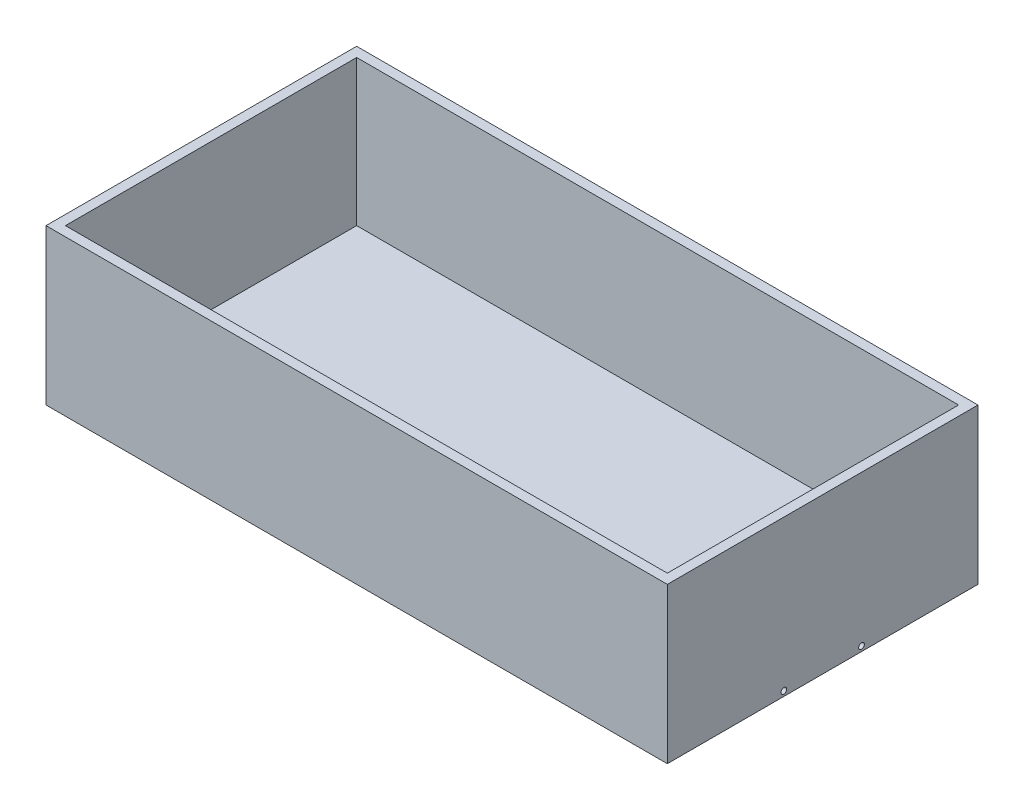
ISO-10303-21;
HEADER;
FILE_DESCRIPTION(('STEP AP214'),'2;1');
FILE_NAME('part.step','',(''),(''),'','','');
FILE_SCHEMA(('AUTOMOTIVE_DESIGN { 1 0 10303 214 1 1 1 1 }'));
ENDSEC;
DATA;
#1=APPLICATION_CONTEXT('core data for automotive mechanical design processes');
#2=APPLICATION_PROTOCOL_DEFINITION('international standard','automotive_design',2000,#1);
#3=PRODUCT_CONTEXT('',#1,'mechanical');
#4=PRODUCT('Part','Part','',(#3));
#5=PRODUCT_RELATED_PRODUCT_CATEGORY('part','',(#4));
#6=PRODUCT_DEFINITION_FORMATION('','',#4);
#7=PRODUCT_DEFINITION_CONTEXT('part definition',#1,'design');
#8=PRODUCT_DEFINITION('design','',#6,#7);
#9=PRODUCT_DEFINITION_SHAPE('','',#8);
#10=(LENGTH_UNIT() NAMED_UNIT(*) SI_UNIT(.MILLI.,.METRE.));
#11=(NAMED_UNIT(*) PLANE_ANGLE_UNIT() SI_UNIT($,.RADIAN.));
#12=(NAMED_UNIT(*) SI_UNIT($,.STERADIAN.) SOLID_ANGLE_UNIT());
#13=UNCERTAINTY_MEASURE_WITH_UNIT(LENGTH_MEASURE(1.E-05),#10,'distance_accuracy_value','');
#14=(GEOMETRIC_REPRESENTATION_CONTEXT(3) GLOBAL_UNCERTAINTY_ASSIGNED_CONTEXT((#13)) GLOBAL_UNIT_ASSIGNED_CONTEXT((#10,
#11,#12)) REPRESENTATION_CONTEXT('',''));
#15=CARTESIAN_POINT('',(0.,0.,0.));
#16=DIRECTION('',(0.,0.,1.));
#17=DIRECTION('',(1.,0.,0.));
#18=AXIS2_PLACEMENT_3D('',#15,#16,#17);
#19=CARTESIAN_POINT('',(-101.6,50.8,50.8));
#20=DIRECTION('',(1.,0.,0.));
#21=DIRECTION('',(0.,0.,-1.));
#22=AXIS2_PLACEMENT_3D('',#19,#20,#21);
#23=PLANE('',#22);
#24=DIRECTION('',(0.,0.,1.));
#25=VECTOR('',#24,1.);
#26=CARTESIAN_POINT('',(-101.6,0.,50.8));
#27=LINE('',#26,#25);
#28=CARTESIAN_POINT('',(-101.6,0.,-50.8));
#29=VERTEX_POINT('',#28);
#30=CARTESIAN_POINT('',(-101.6,0.,50.8));
#31=VERTEX_POINT('',#30);
#32=EDGE_CURVE('E212',#29,#31,#27,.T.);
#33=ORIENTED_EDGE('',*,*,#32,.T.);
#34=DIRECTION('',(0.,-1.,0.));
#35=VECTOR('',#34,1.);
#36=CARTESIAN_POINT('',(-101.6,50.8,50.8));
#37=LINE('',#36,#35);
#38=CARTESIAN_POINT('',(-101.6,50.8,50.8));
#39=VERTEX_POINT('',#38);
#40=EDGE_CURVE('E216',#39,#31,#37,.T.);
#41=ORIENTED_EDGE('',*,*,#40,.F.);
#42=DIRECTION('',(0.,0.,1.));
#43=VECTOR('',#42,1.);
#44=CARTESIAN_POINT('',(-101.6,50.8,50.8));
#45=LINE('',#44,#43);
#46=CARTESIAN_POINT('',(-101.6,50.8,-50.8));
#47=VERTEX_POINT('',#46);
#48=EDGE_CURVE('E204',#47,#39,#45,.T.);
#49=ORIENTED_EDGE('',*,*,#48,.F.);
#50=DIRECTION('',(0.,-1.,0.));
#51=VECTOR('',#50,1.);
#52=CARTESIAN_POINT('',(-101.6,50.8,-50.8));
#53=LINE('',#52,#51);
#54=EDGE_CURVE('E41',#47,#29,#53,.T.);
#55=ORIENTED_EDGE('',*,*,#54,.T.);
#56=EDGE_LOOP('',(#33,#41,#49,#55));
#57=FACE_BOUND('',#56,.T.);
#58=CARTESIAN_POINT('',(-101.6,1.5875,12.696070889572));
#59=DIRECTION('',(-1.,0.,0.));
#60=DIRECTION('',(0.,0.,1.));
#61=AXIS2_PLACEMENT_3D('',#58,#59,#60);
#62=CIRCLE('',#61,0.9271);
#63=CARTESIAN_POINT('',(-101.6,1.5875,13.623170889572));
#64=VERTEX_POINT('',#63);
#65=EDGE_CURVE('E158',#64,#64,#62,.T.);
#66=ORIENTED_EDGE('',*,*,#65,.F.);
#67=EDGE_LOOP('',(#66));
#68=FACE_BOUND('',#67,.T.);
#69=CARTESIAN_POINT('',(-101.6,1.5875,-12.703929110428));
#70=DIRECTION('',(-1.,0.,0.));
#71=DIRECTION('',(0.,0.,1.));
#72=AXIS2_PLACEMENT_3D('',#69,#70,#71);
#73=CIRCLE('',#72,0.927099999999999);
#74=CARTESIAN_POINT('',(-101.6,1.5875,-11.776829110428));
#75=VERTEX_POINT('',#74);
#76=EDGE_CURVE('E146',#75,#75,#73,.T.);
#77=ORIENTED_EDGE('',*,*,#76,.F.);
#78=EDGE_LOOP('',(#77));
#79=FACE_BOUND('',#78,.T.);
#80=ADVANCED_FACE('F33',(#57,#68,#79),#23,.F.);
#81=CARTESIAN_POINT('',(101.6,50.8,50.8));
#82=DIRECTION('',(-1.,0.,0.));
#83=DIRECTION('',(0.,0.,1.));
#84=AXIS2_PLACEMENT_3D('',#81,#82,#83);
#85=PLANE('',#84);
#86=CARTESIAN_POINT('',(101.6,1.5875,-12.703929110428));
#87=DIRECTION('',(1.,0.,0.));
#88=DIRECTION('',(0.,0.,-1.));
#89=AXIS2_PLACEMENT_3D('',#86,#87,#88);
#90=CIRCLE('',#89,0.927099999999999);
#91=CARTESIAN_POINT('',(101.6,1.5875,-13.631029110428));
#92=VERTEX_POINT('',#91);
#93=EDGE_CURVE('E256',#92,#92,#90,.T.);
#94=ORIENTED_EDGE('',*,*,#93,.F.);
#95=EDGE_LOOP('',(#94));
#96=FACE_BOUND('',#95,.T.);
#97=CARTESIAN_POINT('',(101.6,1.5875,12.696070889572));
#98=DIRECTION('',(1.,0.,0.));
#99=DIRECTION('',(0.,0.,-1.));
#100=AXIS2_PLACEMENT_3D('',#97,#98,#99);
#101=CIRCLE('',#100,0.9271);
#102=CARTESIAN_POINT('',(101.6,1.5875,11.768970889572));
#103=VERTEX_POINT('',#102);
#104=EDGE_CURVE('E127',#103,#103,#101,.T.);
#105=ORIENTED_EDGE('',*,*,#104,.F.);
#106=EDGE_LOOP('',(#105));
#107=FACE_BOUND('',#106,.T.);
#108=DIRECTION('',(0.,0.,-1.));
#109=VECTOR('',#108,1.);
#110=CARTESIAN_POINT('',(101.6,0.,50.8));
#111=LINE('',#110,#109);
#112=CARTESIAN_POINT('',(101.6,0.,50.8));
#113=VERTEX_POINT('',#112);
#114=CARTESIAN_POINT('',(101.6,0.,-50.8));
#115=VERTEX_POINT('',#114);
#116=EDGE_CURVE('E195',#113,#115,#111,.T.);
#117=ORIENTED_EDGE('',*,*,#116,.T.);
#118=DIRECTION('',(0.,-1.,0.));
#119=VECTOR('',#118,1.);
#120=CARTESIAN_POINT('',(101.6,50.8,-50.8));
#121=LINE('',#120,#119);
#122=CARTESIAN_POINT('',(101.6,50.8,-50.8));
#123=VERTEX_POINT('',#122);
#124=EDGE_CURVE('E11',#123,#115,#121,.T.);
#125=ORIENTED_EDGE('',*,*,#124,.F.);
#126=DIRECTION('',(0.,0.,-1.));
#127=VECTOR('',#126,1.);
#128=CARTESIAN_POINT('',(101.6,50.8,50.8));
#129=LINE('',#128,#127);
#130=CARTESIAN_POINT('',(101.6,50.8,50.8));
#131=VERTEX_POINT('',#130);
#132=EDGE_CURVE('E201',#131,#123,#129,.T.);
#133=ORIENTED_EDGE('',*,*,#132,.F.);
#134=DIRECTION('',(0.,-1.,0.));
#135=VECTOR('',#134,1.);
#136=CARTESIAN_POINT('',(101.6,50.8,50.8));
#137=LINE('',#136,#135);
#138=EDGE_CURVE('E207',#131,#113,#137,.T.);
#139=ORIENTED_EDGE('',*,*,#138,.T.);
#140=EDGE_LOOP('',(#117,#125,#133,#139));
#141=FACE_BOUND('',#140,.T.);
#142=ADVANCED_FACE('F35',(#96,#107,#141),#85,.F.);
#143=CARTESIAN_POINT('',(-101.6,50.8,-50.8));
#144=DIRECTION('',(0.,0.,1.));
#145=DIRECTION('',(1.,0.,0.));
#146=AXIS2_PLACEMENT_3D('',#143,#144,#145);
#147=PLANE('',#146);
#148=DIRECTION('',(-1.,0.,0.));
#149=VECTOR('',#148,1.);
#150=CARTESIAN_POINT('',(-101.6,0.,-50.8));
#151=LINE('',#150,#149);
#152=EDGE_CURVE('E210',#115,#29,#151,.T.);
#153=ORIENTED_EDGE('',*,*,#152,.T.);
#154=ORIENTED_EDGE('',*,*,#54,.F.);
#155=DIRECTION('',(-1.,0.,0.));
#156=VECTOR('',#155,1.);
#157=CARTESIAN_POINT('',(-101.6,50.8,-50.8));
#158=LINE('',#157,#156);
#159=EDGE_CURVE('E85',#123,#47,#158,.T.);
#160=ORIENTED_EDGE('',*,*,#159,.F.);
#161=ORIENTED_EDGE('',*,*,#124,.T.);
#162=EDGE_LOOP('',(#153,#154,#160,#161));
#163=FACE_BOUND('',#162,.T.);
#164=ADVANCED_FACE('F232',(#163),#147,.F.);
#165=CARTESIAN_POINT('',(-101.6,50.8,50.8));
#166=DIRECTION('',(0.,0.,-1.));
#167=DIRECTION('',(-1.,0.,0.));
#168=AXIS2_PLACEMENT_3D('',#165,#166,#167);
#169=PLANE('',#168);
#170=DIRECTION('',(1.,0.,0.));
#171=VECTOR('',#170,1.);
#172=CARTESIAN_POINT('',(-101.6,0.,50.8));
#173=LINE('',#172,#171);
#174=EDGE_CURVE('E78',#31,#113,#173,.T.);
#175=ORIENTED_EDGE('',*,*,#174,.T.);
#176=ORIENTED_EDGE('',*,*,#138,.F.);
#177=DIRECTION('',(1.,0.,0.));
#178=VECTOR('',#177,1.);
#179=CARTESIAN_POINT('',(-101.6,50.8,50.8));
#180=LINE('',#179,#178);
#181=EDGE_CURVE('E57',#39,#131,#180,.T.);
#182=ORIENTED_EDGE('',*,*,#181,.F.);
#183=ORIENTED_EDGE('',*,*,#40,.T.);
#184=EDGE_LOOP('',(#175,#176,#182,#183));
#185=FACE_BOUND('',#184,.T.);
#186=ADVANCED_FACE('F229',(#185),#169,.F.);
#187=CARTESIAN_POINT('',(0.,50.8,0.));
#188=DIRECTION('',(0.,-1.,0.));
#189=DIRECTION('',(0.,0.,-1.));
#190=AXIS2_PLACEMENT_3D('',#187,#188,#189);
#191=PLANE('',#190);
#192=DIRECTION('',(-1.,0.,0.));
#193=VECTOR('',#192,1.);
#194=CARTESIAN_POINT('',(-98.4249999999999,50.8,-47.625));
#195=LINE('',#194,#193);
#196=CARTESIAN_POINT('',(98.425,50.8,-47.625));
#197=VERTEX_POINT('',#196);
#198=CARTESIAN_POINT('',(-98.4249999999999,50.8,-47.625));
#199=VERTEX_POINT('',#198);
#200=EDGE_CURVE('E185',#197,#199,#195,.T.);
#201=ORIENTED_EDGE('',*,*,#200,.F.);
#202=DIRECTION('',(0.,0.,-1.));
#203=VECTOR('',#202,1.);
#204=CARTESIAN_POINT('',(98.425,50.8,47.625));
#205=LINE('',#204,#203);
#206=CARTESIAN_POINT('',(98.425,50.8,47.625));
#207=VERTEX_POINT('',#206);
#208=EDGE_CURVE('E48',#207,#197,#205,.T.);
#209=ORIENTED_EDGE('',*,*,#208,.F.);
#210=DIRECTION('',(1.,0.,0.));
#211=VECTOR('',#210,1.);
#212=CARTESIAN_POINT('',(-98.4249999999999,50.8,47.625));
#213=LINE('',#212,#211);
#214=CARTESIAN_POINT('',(-98.4249999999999,50.8,47.625));
#215=VERTEX_POINT('',#214);
#216=EDGE_CURVE('E174',#215,#207,#213,.T.);
#217=ORIENTED_EDGE('',*,*,#216,.F.);
#218=DIRECTION('',(0.,0.,1.));
#219=VECTOR('',#218,1.);
#220=CARTESIAN_POINT('',(-98.4249999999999,50.8,47.625));
#221=LINE('',#220,#219);
#222=EDGE_CURVE('E188',#199,#215,#221,.T.);
#223=ORIENTED_EDGE('',*,*,#222,.F.);
#224=EDGE_LOOP('',(#201,#209,#217,#223));
#225=FACE_BOUND('',#224,.T.);
#226=ORIENTED_EDGE('',*,*,#132,.T.);
#227=ORIENTED_EDGE('',*,*,#159,.T.);
#228=ORIENTED_EDGE('',*,*,#48,.T.);
#229=ORIENTED_EDGE('',*,*,#181,.T.);
#230=EDGE_LOOP('',(#226,#227,#228,#229));
#231=FACE_BOUND('',#230,.T.);
#232=ADVANCED_FACE('F231',(#225,#231),#191,.F.);
#233=CARTESIAN_POINT('',(0.,0.,0.));
#234=DIRECTION('',(0.,-1.,0.));
#235=DIRECTION('',(0.,0.,-1.));
#236=AXIS2_PLACEMENT_3D('',#233,#234,#235);
#237=PLANE('',#236);
#238=ORIENTED_EDGE('',*,*,#116,.F.);
#239=ORIENTED_EDGE('',*,*,#174,.F.);
#240=ORIENTED_EDGE('',*,*,#32,.F.);
#241=ORIENTED_EDGE('',*,*,#152,.F.);
#242=EDGE_LOOP('',(#238,#239,#240,#241));
#243=FACE_BOUND('',#242,.T.);
#244=ADVANCED_FACE('F225',(#243),#237,.T.);
#245=CARTESIAN_POINT('',(98.425,3.175,47.625));
#246=DIRECTION('',(1.,0.,0.));
#247=DIRECTION('',(0.,0.,-1.));
#248=AXIS2_PLACEMENT_3D('',#245,#246,#247);
#249=PLANE('',#248);
#250=ORIENTED_EDGE('',*,*,#208,.T.);
#251=DIRECTION('',(0.,1.,0.));
#252=VECTOR('',#251,1.);
#253=CARTESIAN_POINT('',(98.425,3.175,-47.625));
#254=LINE('',#253,#252);
#255=CARTESIAN_POINT('',(98.425,3.175,-47.625));
#256=VERTEX_POINT('',#255);
#257=EDGE_CURVE('E183',#256,#197,#254,.T.);
#258=ORIENTED_EDGE('',*,*,#257,.F.);
#259=DIRECTION('',(0.,0.,-1.));
#260=VECTOR('',#259,1.);
#261=CARTESIAN_POINT('',(98.425,3.175,47.625));
#262=LINE('',#261,#260);
#263=CARTESIAN_POINT('',(98.425,3.175,47.625));
#264=VERTEX_POINT('',#263);
#265=EDGE_CURVE('E170',#264,#256,#262,.T.);
#266=ORIENTED_EDGE('',*,*,#265,.F.);
#267=DIRECTION('',(0.,1.,0.));
#268=VECTOR('',#267,1.);
#269=CARTESIAN_POINT('',(98.425,3.175,47.625));
#270=LINE('',#269,#268);
#271=EDGE_CURVE('E193',#264,#207,#270,.T.);
#272=ORIENTED_EDGE('',*,*,#271,.T.);
#273=EDGE_LOOP('',(#250,#258,#266,#272));
#274=FACE_BOUND('',#273,.T.);
#275=ADVANCED_FACE('F320',(#274),#249,.F.);
#276=CARTESIAN_POINT('',(-98.4249999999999,3.175,47.625));
#277=DIRECTION('',(0.,0.,1.));
#278=DIRECTION('',(1.,0.,0.));
#279=AXIS2_PLACEMENT_3D('',#276,#277,#278);
#280=PLANE('',#279);
#281=ORIENTED_EDGE('',*,*,#216,.T.);
#282=ORIENTED_EDGE('',*,*,#271,.F.);
#283=DIRECTION('',(1.,0.,0.));
#284=VECTOR('',#283,1.);
#285=CARTESIAN_POINT('',(-98.4249999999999,3.175,47.625));
#286=LINE('',#285,#284);
#287=CARTESIAN_POINT('',(-98.4249999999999,3.175,47.625));
#288=VERTEX_POINT('',#287);
#289=EDGE_CURVE('E180',#288,#264,#286,.T.);
#290=ORIENTED_EDGE('',*,*,#289,.F.);
#291=DIRECTION('',(0.,1.,0.));
#292=VECTOR('',#291,1.);
#293=CARTESIAN_POINT('',(-98.4249999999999,3.175,47.625));
#294=LINE('',#293,#292);
#295=EDGE_CURVE('E196',#288,#215,#294,.T.);
#296=ORIENTED_EDGE('',*,*,#295,.T.);
#297=EDGE_LOOP('',(#281,#282,#290,#296));
#298=FACE_BOUND('',#297,.T.);
#299=ADVANCED_FACE('F316',(#298),#280,.F.);
#300=CARTESIAN_POINT('',(-98.4249999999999,3.175,47.625));
#301=DIRECTION('',(-1.,0.,0.));
#302=DIRECTION('',(0.,0.,1.));
#303=AXIS2_PLACEMENT_3D('',#300,#301,#302);
#304=PLANE('',#303);
#305=ORIENTED_EDGE('',*,*,#222,.T.);
#306=ORIENTED_EDGE('',*,*,#295,.F.);
#307=DIRECTION('',(0.,0.,1.));
#308=VECTOR('',#307,1.);
#309=CARTESIAN_POINT('',(-98.4249999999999,3.175,47.625));
#310=LINE('',#309,#308);
#311=CARTESIAN_POINT('',(-98.4249999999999,3.175,-47.625));
#312=VERTEX_POINT('',#311);
#313=EDGE_CURVE('E177',#312,#288,#310,.T.);
#314=ORIENTED_EDGE('',*,*,#313,.F.);
#315=DIRECTION('',(0.,1.,0.));
#316=VECTOR('',#315,1.);
#317=CARTESIAN_POINT('',(-98.4249999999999,3.175,-47.625));
#318=LINE('',#317,#316);
#319=EDGE_CURVE('E198',#312,#199,#318,.T.);
#320=ORIENTED_EDGE('',*,*,#319,.T.);
#321=EDGE_LOOP('',(#305,#306,#314,#320));
#322=FACE_BOUND('',#321,.T.);
#323=ADVANCED_FACE('F319',(#322),#304,.F.);
#324=CARTESIAN_POINT('',(-98.4249999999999,3.175,-47.625));
#325=DIRECTION('',(0.,0.,-1.));
#326=DIRECTION('',(-1.,0.,0.));
#327=AXIS2_PLACEMENT_3D('',#324,#325,#326);
#328=PLANE('',#327);
#329=ORIENTED_EDGE('',*,*,#200,.T.);
#330=ORIENTED_EDGE('',*,*,#319,.F.);
#331=DIRECTION('',(-1.,0.,0.));
#332=VECTOR('',#331,1.);
#333=CARTESIAN_POINT('',(-98.4249999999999,3.175,-47.625));
#334=LINE('',#333,#332);
#335=EDGE_CURVE('E173',#256,#312,#334,.T.);
#336=ORIENTED_EDGE('',*,*,#335,.F.);
#337=ORIENTED_EDGE('',*,*,#257,.T.);
#338=EDGE_LOOP('',(#329,#330,#336,#337));
#339=FACE_BOUND('',#338,.T.);
#340=ADVANCED_FACE('F314',(#339),#328,.F.);
#341=CARTESIAN_POINT('',(0.,3.175,0.));
#342=DIRECTION('',(0.,-1.,0.));
#343=DIRECTION('',(0.,0.,-1.));
#344=AXIS2_PLACEMENT_3D('',#341,#342,#343);
#345=PLANE('',#344);
#346=ORIENTED_EDGE('',*,*,#265,.T.);
#347=ORIENTED_EDGE('',*,*,#335,.T.);
#348=ORIENTED_EDGE('',*,*,#313,.T.);
#349=ORIENTED_EDGE('',*,*,#289,.T.);
#350=EDGE_LOOP('',(#346,#347,#348,#349));
#351=FACE_BOUND('',#350,.T.);
#352=ADVANCED_FACE('F310',(#351),#345,.F.);
#353=CARTESIAN_POINT('',(-96.52,1.5875,12.696070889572));
#354=DIRECTION('',(-1.,0.,0.));
#355=DIRECTION('',(0.,0.,1.));
#356=AXIS2_PLACEMENT_3D('',#353,#354,#355);
#357=CONICAL_SURFACE('',#356,0.755649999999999,1.02974425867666);
#358=CARTESIAN_POINT('',(-96.0659596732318,1.5875,12.696070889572));
#359=VERTEX_POINT('',#358);
#360=VERTEX_LOOP('',#359);
#361=FACE_BOUND('',#360,.T.);
#362=CARTESIAN_POINT('',(-96.52,1.5875,12.696070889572));
#363=DIRECTION('',(-1.,0.,0.));
#364=DIRECTION('',(0.,0.,1.));
#365=AXIS2_PLACEMENT_3D('',#362,#363,#364);
#366=CIRCLE('',#365,0.755649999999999);
#367=CARTESIAN_POINT('',(-96.52,1.5875,13.451720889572));
#368=VERTEX_POINT('',#367);
#369=EDGE_CURVE('E167',#368,#368,#366,.T.);
#370=ORIENTED_EDGE('',*,*,#369,.T.);
#371=EDGE_LOOP('',(#370));
#372=FACE_BOUND('',#371,.T.);
#373=ADVANCED_FACE('F306',(#361,#372),#357,.F.);
#374=CARTESIAN_POINT('',(-101.6,1.5875,12.696070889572));
#375=DIRECTION('',(-1.,0.,0.));
#376=DIRECTION('',(0.,0.,1.));
#377=AXIS2_PLACEMENT_3D('',#374,#375,#376);
#378=CYLINDRICAL_SURFACE('',#377,0.755649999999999);
#379=ORIENTED_EDGE('',*,*,#369,.F.);
#380=EDGE_LOOP('',(#379));
#381=FACE_BOUND('',#380,.T.);
#382=CARTESIAN_POINT('',(-97.79,1.5875,12.696070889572));
#383=DIRECTION('',(-1.,0.,0.));
#384=DIRECTION('',(0.,0.,1.));
#385=AXIS2_PLACEMENT_3D('',#382,#383,#384);
#386=CIRCLE('',#385,0.755649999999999);
#387=CARTESIAN_POINT('',(-97.79,1.5875,13.451720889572));
#388=VERTEX_POINT('',#387);
#389=EDGE_CURVE('E164',#388,#388,#386,.T.);
#390=ORIENTED_EDGE('',*,*,#389,.T.);
#391=EDGE_LOOP('',(#390));
#392=FACE_BOUND('',#391,.T.);
#393=ADVANCED_FACE('F302',(#381,#392),#378,.F.);
#394=CARTESIAN_POINT('',(-97.79,2.34315,12.696070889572));
#395=DIRECTION('',(1.,0.,0.));
#396=DIRECTION('',(0.,0.,-1.));
#397=AXIS2_PLACEMENT_3D('',#394,#395,#396);
#398=PLANE('',#397);
#399=ORIENTED_EDGE('',*,*,#389,.F.);
#400=EDGE_LOOP('',(#399));
#401=FACE_BOUND('',#400,.T.);
#402=CARTESIAN_POINT('',(-97.79,1.5875,12.696070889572));
#403=DIRECTION('',(-1.,0.,0.));
#404=DIRECTION('',(0.,0.,1.));
#405=AXIS2_PLACEMENT_3D('',#402,#403,#404);
#406=CIRCLE('',#405,0.927099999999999);
#407=CARTESIAN_POINT('',(-97.79,1.5875,13.623170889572));
#408=VERTEX_POINT('',#407);
#409=EDGE_CURVE('E161',#408,#408,#406,.T.);
#410=ORIENTED_EDGE('',*,*,#409,.T.);
#411=EDGE_LOOP('',(#410));
#412=FACE_BOUND('',#411,.T.);
#413=ADVANCED_FACE('F298',(#401,#412),#398,.F.);
#414=CARTESIAN_POINT('',(-101.6,1.5875,12.696070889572));
#415=DIRECTION('',(-1.,0.,0.));
#416=DIRECTION('',(0.,0.,1.));
#417=AXIS2_PLACEMENT_3D('',#414,#415,#416);
#418=CYLINDRICAL_SURFACE('',#417,0.927099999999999);
#419=ORIENTED_EDGE('',*,*,#409,.F.);
#420=EDGE_LOOP('',(#419));
#421=FACE_BOUND('',#420,.T.);
#422=ORIENTED_EDGE('',*,*,#65,.T.);
#423=EDGE_LOOP('',(#422));
#424=FACE_BOUND('',#423,.T.);
#425=ADVANCED_FACE('F294',(#421,#424),#418,.F.);
#426=CARTESIAN_POINT('',(-96.52,1.5875,-12.703929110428));
#427=DIRECTION('',(-1.,0.,0.));
#428=DIRECTION('',(0.,0.,1.));
#429=AXIS2_PLACEMENT_3D('',#426,#427,#428);
#430=CONICAL_SURFACE('',#429,0.755649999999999,1.02974425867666);
#431=CARTESIAN_POINT('',(-96.0659596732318,1.5875,-12.703929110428));
#432=VERTEX_POINT('',#431);
#433=VERTEX_LOOP('',#432);
#434=FACE_BOUND('',#433,.T.);
#435=CARTESIAN_POINT('',(-96.52,1.5875,-12.703929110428));
#436=DIRECTION('',(-1.,0.,0.));
#437=DIRECTION('',(0.,0.,1.));
#438=AXIS2_PLACEMENT_3D('',#435,#436,#437);
#439=CIRCLE('',#438,0.755649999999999);
#440=CARTESIAN_POINT('',(-96.52,1.5875,-11.948279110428));
#441=VERTEX_POINT('',#440);
#442=EDGE_CURVE('E155',#441,#441,#439,.T.);
#443=ORIENTED_EDGE('',*,*,#442,.T.);
#444=EDGE_LOOP('',(#443));
#445=FACE_BOUND('',#444,.T.);
#446=ADVANCED_FACE('F290',(#434,#445),#430,.F.);
#447=CARTESIAN_POINT('',(-101.6,1.5875,-12.703929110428));
#448=DIRECTION('',(-1.,0.,0.));
#449=DIRECTION('',(0.,0.,1.));
#450=AXIS2_PLACEMENT_3D('',#447,#448,#449);
#451=CYLINDRICAL_SURFACE('',#450,0.755649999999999);
#452=ORIENTED_EDGE('',*,*,#442,.F.);
#453=EDGE_LOOP('',(#452));
#454=FACE_BOUND('',#453,.T.);
#455=CARTESIAN_POINT('',(-97.79,1.5875,-12.703929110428));
#456=DIRECTION('',(-1.,0.,0.));
#457=DIRECTION('',(0.,0.,1.));
#458=AXIS2_PLACEMENT_3D('',#455,#456,#457);
#459=CIRCLE('',#458,0.755649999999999);
#460=CARTESIAN_POINT('',(-97.79,1.5875,-11.948279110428));
#461=VERTEX_POINT('',#460);
#462=EDGE_CURVE('E152',#461,#461,#459,.T.);
#463=ORIENTED_EDGE('',*,*,#462,.T.);
#464=EDGE_LOOP('',(#463));
#465=FACE_BOUND('',#464,.T.);
#466=ADVANCED_FACE('F286',(#454,#465),#451,.F.);
#467=CARTESIAN_POINT('',(-97.79,2.34315,-12.703929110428));
#468=DIRECTION('',(1.,0.,0.));
#469=DIRECTION('',(0.,0.,-1.));
#470=AXIS2_PLACEMENT_3D('',#467,#468,#469);
#471=PLANE('',#470);
#472=ORIENTED_EDGE('',*,*,#462,.F.);
#473=EDGE_LOOP('',(#472));
#474=FACE_BOUND('',#473,.T.);
#475=CARTESIAN_POINT('',(-97.79,1.5875,-12.703929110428));
#476=DIRECTION('',(-1.,0.,0.));
#477=DIRECTION('',(0.,0.,1.));
#478=AXIS2_PLACEMENT_3D('',#475,#476,#477);
#479=CIRCLE('',#478,0.927099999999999);
#480=CARTESIAN_POINT('',(-97.79,1.5875,-11.776829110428));
#481=VERTEX_POINT('',#480);
#482=EDGE_CURVE('E149',#481,#481,#479,.T.);
#483=ORIENTED_EDGE('',*,*,#482,.T.);
#484=EDGE_LOOP('',(#483));
#485=FACE_BOUND('',#484,.T.);
#486=ADVANCED_FACE('F282',(#474,#485),#471,.F.);
#487=CARTESIAN_POINT('',(-101.6,1.5875,-12.703929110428));
#488=DIRECTION('',(-1.,0.,0.));
#489=DIRECTION('',(0.,0.,1.));
#490=AXIS2_PLACEMENT_3D('',#487,#488,#489);
#491=CYLINDRICAL_SURFACE('',#490,0.927099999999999);
#492=ORIENTED_EDGE('',*,*,#482,.F.);
#493=EDGE_LOOP('',(#492));
#494=FACE_BOUND('',#493,.T.);
#495=ORIENTED_EDGE('',*,*,#76,.T.);
#496=EDGE_LOOP('',(#495));
#497=FACE_BOUND('',#496,.T.);
#498=ADVANCED_FACE('F278',(#494,#497),#491,.F.);
#499=CARTESIAN_POINT('',(96.52,1.5875,12.696070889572));
#500=DIRECTION('',(1.,0.,0.));
#501=DIRECTION('',(0.,0.,-1.));
#502=AXIS2_PLACEMENT_3D('',#499,#500,#501);
#503=CONICAL_SURFACE('',#502,0.755649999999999,1.02974425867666);
#504=CARTESIAN_POINT('',(96.0659596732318,1.5875,12.696070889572));
#505=VERTEX_POINT('',#504);
#506=VERTEX_LOOP('',#505);
#507=FACE_BOUND('',#506,.T.);
#508=CARTESIAN_POINT('',(96.52,1.5875,12.696070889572));
#509=DIRECTION('',(1.,0.,0.));
#510=DIRECTION('',(0.,0.,-1.));
#511=AXIS2_PLACEMENT_3D('',#508,#509,#510);
#512=CIRCLE('',#511,0.755649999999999);
#513=CARTESIAN_POINT('',(96.52,1.5875,11.940420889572));
#514=VERTEX_POINT('',#513);
#515=EDGE_CURVE('E143',#514,#514,#512,.T.);
#516=ORIENTED_EDGE('',*,*,#515,.T.);
#517=EDGE_LOOP('',(#516));
#518=FACE_BOUND('',#517,.T.);
#519=ADVANCED_FACE('F274',(#507,#518),#503,.F.);
#520=CARTESIAN_POINT('',(101.6,1.5875,12.696070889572));
#521=DIRECTION('',(1.,0.,0.));
#522=DIRECTION('',(0.,0.,-1.));
#523=AXIS2_PLACEMENT_3D('',#520,#521,#522);
#524=CYLINDRICAL_SURFACE('',#523,0.755649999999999);
#525=ORIENTED_EDGE('',*,*,#515,.F.);
#526=EDGE_LOOP('',(#525));
#527=FACE_BOUND('',#526,.T.);
#528=CARTESIAN_POINT('',(97.79,1.5875,12.696070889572));
#529=DIRECTION('',(1.,0.,0.));
#530=DIRECTION('',(0.,0.,-1.));
#531=AXIS2_PLACEMENT_3D('',#528,#529,#530);
#532=CIRCLE('',#531,0.755649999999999);
#533=CARTESIAN_POINT('',(97.79,1.5875,11.940420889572));
#534=VERTEX_POINT('',#533);
#535=EDGE_CURVE('E140',#534,#534,#532,.T.);
#536=ORIENTED_EDGE('',*,*,#535,.T.);
#537=EDGE_LOOP('',(#536));
#538=FACE_BOUND('',#537,.T.);
#539=ADVANCED_FACE('F266',(#527,#538),#524,.F.);
#540=CARTESIAN_POINT('',(97.79,2.34315,12.696070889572));
#541=DIRECTION('',(-1.,0.,0.));
#542=DIRECTION('',(0.,0.,1.));
#543=AXIS2_PLACEMENT_3D('',#540,#541,#542);
#544=PLANE('',#543);
#545=ORIENTED_EDGE('',*,*,#535,.F.);
#546=EDGE_LOOP('',(#545));
#547=FACE_BOUND('',#546,.T.);
#548=CARTESIAN_POINT('',(97.79,1.5875,12.696070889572));
#549=DIRECTION('',(1.,0.,0.));
#550=DIRECTION('',(0.,0.,-1.));
#551=AXIS2_PLACEMENT_3D('',#548,#549,#550);
#552=CIRCLE('',#551,0.927099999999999);
#553=CARTESIAN_POINT('',(97.79,1.5875,11.768970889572));
#554=VERTEX_POINT('',#553);
#555=EDGE_CURVE('E131',#554,#554,#552,.T.);
#556=ORIENTED_EDGE('',*,*,#555,.T.);
#557=EDGE_LOOP('',(#556));
#558=FACE_BOUND('',#557,.T.);
#559=ADVANCED_FACE('F260',(#547,#558),#544,.F.);
#560=CARTESIAN_POINT('',(101.6,1.5875,12.696070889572));
#561=DIRECTION('',(1.,0.,0.));
#562=DIRECTION('',(0.,0.,-1.));
#563=AXIS2_PLACEMENT_3D('',#560,#561,#562);
#564=CYLINDRICAL_SURFACE('',#563,0.927099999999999);
#565=ORIENTED_EDGE('',*,*,#555,.F.);
#566=EDGE_LOOP('',(#565));
#567=FACE_BOUND('',#566,.T.);
#568=ORIENTED_EDGE('',*,*,#104,.T.);
#569=EDGE_LOOP('',(#568));
#570=FACE_BOUND('',#569,.T.);
#571=ADVANCED_FACE('F121',(#567,#570),#564,.F.);
#572=CARTESIAN_POINT('',(96.52,1.5875,-12.703929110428));
#573=DIRECTION('',(1.,0.,0.));
#574=DIRECTION('',(0.,0.,-1.));
#575=AXIS2_PLACEMENT_3D('',#572,#573,#574);
#576=CONICAL_SURFACE('',#575,0.755649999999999,1.02974425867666);
#577=CARTESIAN_POINT('',(96.0659596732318,1.5875,-12.703929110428));
#578=VERTEX_POINT('',#577);
#579=VERTEX_LOOP('',#578);
#580=FACE_BOUND('',#579,.T.);
#581=CARTESIAN_POINT('',(96.52,1.5875,-12.703929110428));
#582=DIRECTION('',(1.,0.,0.));
#583=DIRECTION('',(0.,0.,-1.));
#584=AXIS2_PLACEMENT_3D('',#581,#582,#583);
#585=CIRCLE('',#584,0.755649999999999);
#586=CARTESIAN_POINT('',(96.52,1.5875,-13.459579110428));
#587=VERTEX_POINT('',#586);
#588=EDGE_CURVE('E125',#587,#587,#585,.T.);
#589=ORIENTED_EDGE('',*,*,#588,.T.);
#590=EDGE_LOOP('',(#589));
#591=FACE_BOUND('',#590,.T.);
#592=ADVANCED_FACE('F117',(#580,#591),#576,.F.);
#593=CARTESIAN_POINT('',(101.6,1.5875,-12.703929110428));
#594=DIRECTION('',(1.,0.,0.));
#595=DIRECTION('',(0.,0.,-1.));
#596=AXIS2_PLACEMENT_3D('',#593,#594,#595);
#597=CYLINDRICAL_SURFACE('',#596,0.755649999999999);
#598=ORIENTED_EDGE('',*,*,#588,.F.);
#599=EDGE_LOOP('',(#598));
#600=FACE_BOUND('',#599,.T.);
#601=CARTESIAN_POINT('',(97.79,1.5875,-12.703929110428));
#602=DIRECTION('',(1.,0.,0.));
#603=DIRECTION('',(0.,0.,-1.));
#604=AXIS2_PLACEMENT_3D('',#601,#602,#603);
#605=CIRCLE('',#604,0.755649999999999);
#606=CARTESIAN_POINT('',(97.79,1.5875,-13.459579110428));
#607=VERTEX_POINT('',#606);
#608=EDGE_CURVE('E128',#607,#607,#605,.T.);
#609=ORIENTED_EDGE('',*,*,#608,.T.);
#610=EDGE_LOOP('',(#609));
#611=FACE_BOUND('',#610,.T.);
#612=ADVANCED_FACE('F120',(#600,#611),#597,.F.);
#613=CARTESIAN_POINT('',(97.79,2.34315,-12.703929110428));
#614=DIRECTION('',(-1.,0.,0.));
#615=DIRECTION('',(0.,0.,1.));
#616=AXIS2_PLACEMENT_3D('',#613,#614,#615);
#617=PLANE('',#616);
#618=ORIENTED_EDGE('',*,*,#608,.F.);
#619=EDGE_LOOP('',(#618));
#620=FACE_BOUND('',#619,.T.);
#621=CARTESIAN_POINT('',(97.79,1.5875,-12.703929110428));
#622=DIRECTION('',(1.,0.,0.));
#623=DIRECTION('',(0.,0.,-1.));
#624=AXIS2_PLACEMENT_3D('',#621,#622,#623);
#625=CIRCLE('',#624,0.927099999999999);
#626=CARTESIAN_POINT('',(97.79,1.5875,-13.631029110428));
#627=VERTEX_POINT('',#626);
#628=EDGE_CURVE('E134',#627,#627,#625,.T.);
#629=ORIENTED_EDGE('',*,*,#628,.T.);
#630=EDGE_LOOP('',(#629));
#631=FACE_BOUND('',#630,.T.);
#632=ADVANCED_FACE('F417',(#620,#631),#617,.F.);
#633=CARTESIAN_POINT('',(101.6,1.5875,-12.703929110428));
#634=DIRECTION('',(1.,0.,0.));
#635=DIRECTION('',(0.,0.,-1.));
#636=AXIS2_PLACEMENT_3D('',#633,#634,#635);
#637=CYLINDRICAL_SURFACE('',#636,0.927099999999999);
#638=ORIENTED_EDGE('',*,*,#628,.F.);
#639=EDGE_LOOP('',(#638));
#640=FACE_BOUND('',#639,.T.);
#641=ORIENTED_EDGE('',*,*,#93,.T.);
#642=EDGE_LOOP('',(#641));
#643=FACE_BOUND('',#642,.T.);
#644=ADVANCED_FACE('F425',(#640,#643),#637,.F.);
#645=CLOSED_SHELL('',(#80,#142,#164,#186,#232,#244,#275,#299,#323,#340,#352,#373,#393,#413,#425,
#446,#466,#486,#498,#519,#539,#559,#571,#592,#612,#632,#644));
#646=MANIFOLD_SOLID_BREP('B2',#645);
#647=ADVANCED_BREP_SHAPE_REPRESENTATION('',(#18,#646),#14);
#648=SHAPE_DEFINITION_REPRESENTATION(#9,#647);
ENDSEC;
END-ISO-10303-21;
